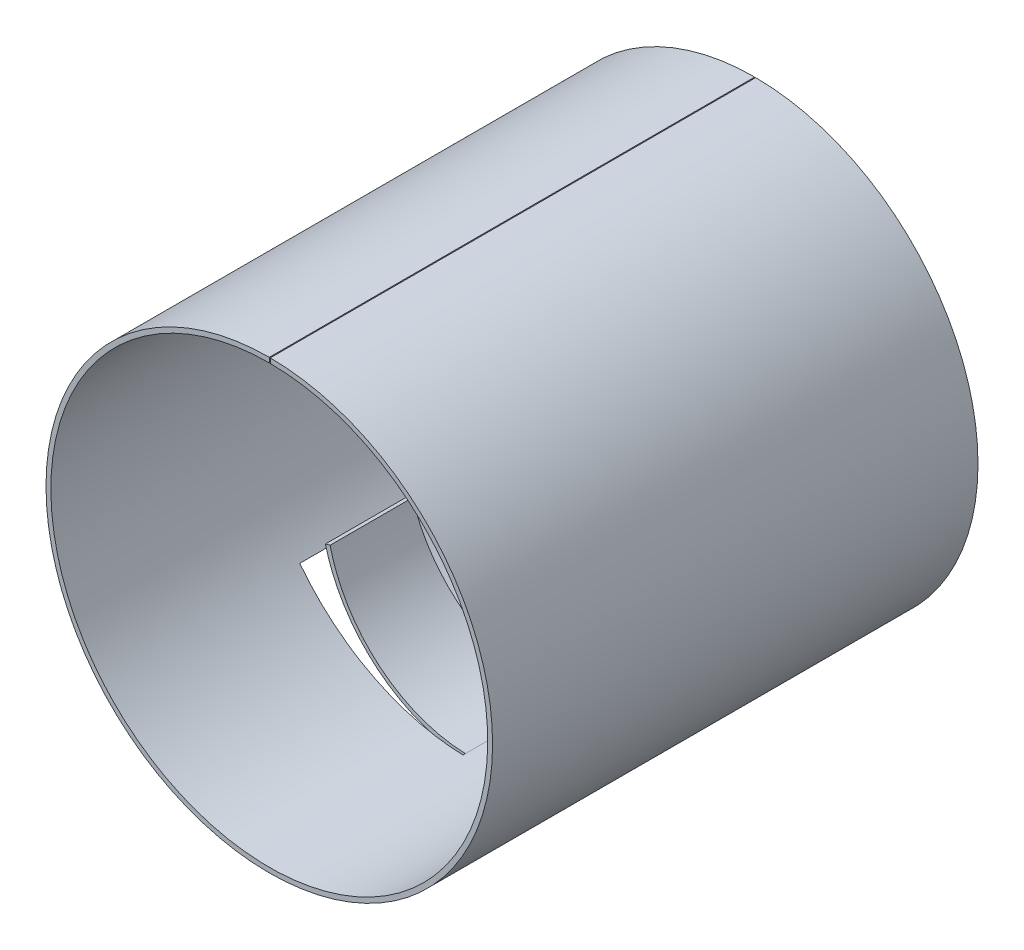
ISO-10303-21;
HEADER;
FILE_DESCRIPTION(('STEP AP214'),'2;1');
FILE_NAME('part.step','',(''),(''),'','','');
FILE_SCHEMA(('AUTOMOTIVE_DESIGN { 1 0 10303 214 1 1 1 1 }'));
ENDSEC;
DATA;
#1=APPLICATION_CONTEXT('core data for automotive mechanical design processes');
#2=APPLICATION_PROTOCOL_DEFINITION('international standard','automotive_design',2000,#1);
#3=PRODUCT_CONTEXT('',#1,'mechanical');
#4=PRODUCT('Part','Part','',(#3));
#5=PRODUCT_RELATED_PRODUCT_CATEGORY('part','',(#4));
#6=PRODUCT_DEFINITION_FORMATION('','',#4);
#7=PRODUCT_DEFINITION_CONTEXT('part definition',#1,'design');
#8=PRODUCT_DEFINITION('design','',#6,#7);
#9=PRODUCT_DEFINITION_SHAPE('','',#8);
#10=(LENGTH_UNIT() NAMED_UNIT(*) SI_UNIT(.MILLI.,.METRE.));
#11=(NAMED_UNIT(*) PLANE_ANGLE_UNIT() SI_UNIT($,.RADIAN.));
#12=(NAMED_UNIT(*) SI_UNIT($,.STERADIAN.) SOLID_ANGLE_UNIT());
#13=UNCERTAINTY_MEASURE_WITH_UNIT(LENGTH_MEASURE(1.E-05),#10,'distance_accuracy_value','');
#14=(GEOMETRIC_REPRESENTATION_CONTEXT(3) GLOBAL_UNCERTAINTY_ASSIGNED_CONTEXT((#13)) GLOBAL_UNIT_ASSIGNED_CONTEXT((#10,
#11,#12)) REPRESENTATION_CONTEXT('',''));
#15=CARTESIAN_POINT('',(0.,0.,0.));
#16=DIRECTION('',(0.,0.,1.));
#17=DIRECTION('',(1.,0.,0.));
#18=AXIS2_PLACEMENT_3D('',#15,#16,#17);
#19=CARTESIAN_POINT('',(-0.0997454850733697,-44.9998894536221,50.));
#20=DIRECTION('',(0.999997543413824,-0.00221656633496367,0.));
#21=DIRECTION('',(0.,0.,1.));
#22=AXIS2_PLACEMENT_3D('',#19,#20,#21);
#23=PLANE('',#22);
#24=DIRECTION('',(0.,0.,-1.));
#25=VECTOR('',#24,1.);
#26=CARTESIAN_POINT('',(-0.101962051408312,-45.9998869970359,352.681192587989));
#27=LINE('',#26,#25);
#28=CARTESIAN_POINT('',(-0.101962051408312,-45.9998869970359,40.));
#29=VERTEX_POINT('',#28);
#30=CARTESIAN_POINT('',(-0.101962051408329,-45.9998869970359,40.5));
#31=VERTEX_POINT('',#30);
#32=EDGE_CURVE('E467',#29,#31,#27,.F.);
#33=ORIENTED_EDGE('',*,*,#32,.T.);
#34=DIRECTION('',(-0.00221656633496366,-0.999997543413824,0.));
#35=VECTOR('',#34,1.);
#36=CARTESIAN_POINT('',(-0.101962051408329,-45.9998869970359,40.5));
#37=LINE('',#36,#35);
#38=CARTESIAN_POINT('',(-0.0997454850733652,-44.9998894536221,40.5));
#39=VERTEX_POINT('',#38);
#40=EDGE_CURVE('E254',#39,#31,#37,.T.);
#41=ORIENTED_EDGE('',*,*,#40,.F.);
#42=DIRECTION('',(0.,0.,1.));
#43=VECTOR('',#42,1.);
#44=CARTESIAN_POINT('',(-0.0997454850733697,-44.9998894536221,40.));
#45=LINE('',#44,#43);
#46=CARTESIAN_POINT('',(-0.0997454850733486,-44.9998894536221,40.));
#47=VERTEX_POINT('',#46);
#48=EDGE_CURVE('E245',#47,#39,#45,.T.);
#49=ORIENTED_EDGE('',*,*,#48,.F.);
#50=CARTESIAN_POINT('',(-0.101962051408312,-45.9998869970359,40.));
#51=CARTESIAN_POINT('',(-0.0997454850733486,-44.9998894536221,40.));
#52=B_SPLINE_CURVE_WITH_KNOTS('',1,(#50,#51),.UNSPECIFIED.,.F.,.F.,(2,2),(0.,1.),.UNSPECIFIED.);
#53=EDGE_CURVE('E146',#29,#47,#52,.T.);
#54=ORIENTED_EDGE('',*,*,#53,.F.);
#55=EDGE_LOOP('',(#33,#41,#49,#54));
#56=FACE_BOUND('',#55,.T.);
#57=ADVANCED_FACE('F136',(#56),#23,.F.);
#58=CARTESIAN_POINT('',(-0.0997454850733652,-44.9998894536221,59.5));
#59=VERTEX_POINT('',#58);
#60=CARTESIAN_POINT('',(-0.0997454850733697,-44.9998894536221,60.));
#61=VERTEX_POINT('',#60);
#62=EDGE_CURVE('E248',#59,#61,#45,.T.);
#63=ORIENTED_EDGE('',*,*,#62,.F.);
#64=DIRECTION('',(0.00221656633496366,0.999997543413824,0.));
#65=VECTOR('',#64,1.);
#66=CARTESIAN_POINT('',(-0.101962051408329,-45.9998869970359,59.5));
#67=LINE('',#66,#65);
#68=CARTESIAN_POINT('',(-0.101962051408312,-45.9998869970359,59.5));
#69=VERTEX_POINT('',#68);
#70=EDGE_CURVE('E279',#69,#59,#67,.T.);
#71=ORIENTED_EDGE('',*,*,#70,.F.);
#72=CARTESIAN_POINT('',(-0.101962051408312,-45.9998869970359,60.));
#73=VERTEX_POINT('',#72);
#74=EDGE_CURVE('E269',#69,#73,#27,.F.);
#75=ORIENTED_EDGE('',*,*,#74,.T.);
#76=CARTESIAN_POINT('',(-0.0997454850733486,-44.9998894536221,60.));
#77=CARTESIAN_POINT('',(-0.101962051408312,-45.9998869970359,60.));
#78=B_SPLINE_CURVE_WITH_KNOTS('',1,(#76,#77),.UNSPECIFIED.,.F.,.F.,(2,2),(0.,1.),.UNSPECIFIED.);
#79=EDGE_CURVE('E236',#73,#61,#78,.F.);
#80=ORIENTED_EDGE('',*,*,#79,.T.);
#81=EDGE_LOOP('',(#63,#71,#75,#80));
#82=FACE_BOUND('',#81,.T.);
#83=ADVANCED_FACE('F406',(#82),#23,.F.);
#84=CARTESIAN_POINT('',(-35.4931558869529,-29.2615085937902,41.));
#85=CARTESIAN_POINT('',(-33.3494174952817,-31.8617860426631,40.9166651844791));
#86=CARTESIAN_POINT('',(-30.9189542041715,-34.225354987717,40.8333333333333));
#87=CARTESIAN_POINT('',(-25.6009059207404,-38.3660040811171,40.6666666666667));
#88=CARTESIAN_POINT('',(-22.713565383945,-40.1428773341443,40.5833333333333));
#89=CARTESIAN_POINT('',(-16.6207165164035,-43.0245097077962,40.4166666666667));
#90=CARTESIAN_POINT('',(-13.4154445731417,-44.1291570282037,40.3333333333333));
#91=CARTESIAN_POINT('',(-6.8409173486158,-45.6131395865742,40.1666666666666));
#92=CARTESIAN_POINT('',(-3.47197708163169,-45.9924171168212,40.0833348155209));
#93=CARTESIAN_POINT('',(-0.101962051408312,-45.9998869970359,40.));
#94=CARTESIAN_POINT('',(-34.7215655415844,-28.6253888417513,41.));
#95=CARTESIAN_POINT('',(-32.624430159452,-31.1691385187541,40.9166651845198));
#96=CARTESIAN_POINT('',(-30.2468030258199,-33.4813255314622,40.8333333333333));
#97=CARTESIAN_POINT('',(-25.0443644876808,-37.5319605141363,40.6666666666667));
#98=CARTESIAN_POINT('',(-22.2197922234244,-39.2702060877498,40.5833333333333));
#99=CARTESIAN_POINT('',(-16.2593965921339,-42.0891942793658,40.4166666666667));
#100=CARTESIAN_POINT('',(-13.1238044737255,-43.1698275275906,40.3333333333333));
#101=CARTESIAN_POINT('',(-6.69220175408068,-44.6215495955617,40.1666666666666));
#102=CARTESIAN_POINT('',(-3.39649931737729,-44.9925819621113,40.0833348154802));
#103=CARTESIAN_POINT('',(-0.0997454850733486,-44.9998894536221,40.));
#104=B_SPLINE_SURFACE_WITH_KNOTS('',1,3,((#84,#85,#86,#87,#88,#89,#90,#91,#92,#93),(#94,#95,#96,
#97,#98,#99,#100,#101,#102,#103)),.UNSPECIFIED.,.F.,.F.,.F.,(2,2),(4,2,2,2,4),(0.,1.),(0.,0.25,
0.5,0.75,1.),.UNSPECIFIED.);
#105=CARTESIAN_POINT('',(-34.7215655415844,-28.6253888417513,41.));
#106=CARTESIAN_POINT('',(-35.4931558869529,-29.2615085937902,41.));
#107=B_SPLINE_CURVE_WITH_KNOTS('',1,(#105,#106),.UNSPECIFIED.,.F.,.F.,(2,2),(0.,1.),.UNSPECIFIED.);
#108=CARTESIAN_POINT('',(-35.4931558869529,-29.2615085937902,41.));
#109=VERTEX_POINT('',#108);
#110=CARTESIAN_POINT('',(-34.7215655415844,-28.6253888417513,41.));
#111=VERTEX_POINT('',#110);
#112=EDGE_CURVE('E13',#109,#111,#107,.F.);
#113=CARTESIAN_POINT('',(-35.4931558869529,-29.2615085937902,41.));
#114=CARTESIAN_POINT('',(-33.3494174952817,-31.8617860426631,40.9166651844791));
#115=CARTESIAN_POINT('',(-30.9189542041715,-34.225354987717,40.8333333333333));
#116=CARTESIAN_POINT('',(-25.6009059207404,-38.3660040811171,40.6666666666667));
#117=CARTESIAN_POINT('',(-22.713565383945,-40.1428773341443,40.5833333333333));
#118=CARTESIAN_POINT('',(-16.6207165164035,-43.0245097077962,40.4166666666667));
#119=CARTESIAN_POINT('',(-13.4154445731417,-44.1291570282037,40.3333333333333));
#120=CARTESIAN_POINT('',(-6.8409173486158,-45.6131395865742,40.1666666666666));
#121=CARTESIAN_POINT('',(-3.47197708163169,-45.9924171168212,40.0833348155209));
#122=CARTESIAN_POINT('',(-0.101962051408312,-45.9998869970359,40.));
#123=B_SPLINE_CURVE_WITH_KNOTS('',3,(#113,#114,#115,#116,#117,#118,#119,#120,#121,#122),
.UNSPECIFIED.,.F.,.F.,(4,2,2,2,4),(0.,0.25,0.5,0.75,1.),.UNSPECIFIED.);
#124=EDGE_CURVE('E229',#109,#29,#123,.T.);
#125=CARTESIAN_POINT('',(-0.0997454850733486,-44.9998894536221,40.));
#126=CARTESIAN_POINT('',(-3.39649931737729,-44.9925819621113,40.0833348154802));
#127=CARTESIAN_POINT('',(-6.69220175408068,-44.6215495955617,40.1666666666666));
#128=CARTESIAN_POINT('',(-13.1238044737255,-43.1698275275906,40.3333333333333));
#129=CARTESIAN_POINT('',(-16.2593965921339,-42.0891942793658,40.4166666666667));
#130=CARTESIAN_POINT('',(-22.2197922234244,-39.2702060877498,40.5833333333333));
#131=CARTESIAN_POINT('',(-25.0443644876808,-37.5319605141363,40.6666666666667));
#132=CARTESIAN_POINT('',(-30.2468030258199,-33.4813255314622,40.8333333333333));
#133=CARTESIAN_POINT('',(-32.624430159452,-31.1691385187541,40.9166651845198));
#134=CARTESIAN_POINT('',(-34.7215655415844,-28.6253888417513,41.));
#135=B_SPLINE_CURVE_WITH_KNOTS('',3,(#125,#126,#127,#128,#129,#130,#131,#132,#133,#134),
.UNSPECIFIED.,.F.,.F.,(4,2,2,2,4),(0.,0.25,0.5,0.75,1.),.UNSPECIFIED.);
#136=EDGE_CURVE('E225',#111,#47,#135,.F.);
#137=ORIENTED_EDGE('',*,*,#112,.F.);
#138=ORIENTED_EDGE('',*,*,#124,.T.);
#139=ORIENTED_EDGE('',*,*,#53,.T.);
#140=ORIENTED_EDGE('',*,*,#136,.F.);
#141=EDGE_LOOP('',(#137,#138,#139,#140));
#142=FACE_BOUND('',#141,.T.);
#143=ADVANCED_FACE('F224',(#142),#104,.F.);
#144=CARTESIAN_POINT('',(-0.101962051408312,-45.9998869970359,60.));
#145=CARTESIAN_POINT('',(-3.47197708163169,-45.9924171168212,59.9166651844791));
#146=CARTESIAN_POINT('',(-6.8409173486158,-45.6131395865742,59.8333333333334));
#147=CARTESIAN_POINT('',(-13.4154445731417,-44.1291570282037,59.6666666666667));
#148=CARTESIAN_POINT('',(-16.6207165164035,-43.0245097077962,59.5833333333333));
#149=CARTESIAN_POINT('',(-22.713565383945,-40.1428773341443,59.4166666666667));
#150=CARTESIAN_POINT('',(-25.6009059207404,-38.3660040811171,59.3333333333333));
#151=CARTESIAN_POINT('',(-30.9189542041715,-34.225354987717,59.1666666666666));
#152=CARTESIAN_POINT('',(-33.3494174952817,-31.8617860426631,59.0833348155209));
#153=CARTESIAN_POINT('',(-35.4931558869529,-29.2615085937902,59.));
#154=CARTESIAN_POINT('',(-0.0997454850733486,-44.9998894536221,60.));
#155=CARTESIAN_POINT('',(-3.39649931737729,-44.9925819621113,59.9166651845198));
#156=CARTESIAN_POINT('',(-6.69220175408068,-44.6215495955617,59.8333333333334));
#157=CARTESIAN_POINT('',(-13.1238044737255,-43.1698275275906,59.6666666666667));
#158=CARTESIAN_POINT('',(-16.2593965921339,-42.0891942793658,59.5833333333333));
#159=CARTESIAN_POINT('',(-22.2197922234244,-39.2702060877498,59.4166666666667));
#160=CARTESIAN_POINT('',(-25.0443644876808,-37.5319605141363,59.3333333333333));
#161=CARTESIAN_POINT('',(-30.2468030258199,-33.4813255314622,59.1666666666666));
#162=CARTESIAN_POINT('',(-32.624430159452,-31.1691385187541,59.0833348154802));
#163=CARTESIAN_POINT('',(-34.7215655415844,-28.6253888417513,59.));
#164=B_SPLINE_SURFACE_WITH_KNOTS('',1,3,((#144,#145,#146,#147,#148,#149,#150,#151,#152,#153),
(#154,#155,#156,#157,#158,#159,#160,#161,#162,#163)),.UNSPECIFIED.,.F.,.F.,.F.,(2,2),(4,2,2,2,
4),(0.,1.),(0.,0.25,0.5,0.75,1.),.UNSPECIFIED.);
#165=CARTESIAN_POINT('',(-0.101962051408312,-45.9998869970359,60.));
#166=CARTESIAN_POINT('',(-3.47197708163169,-45.9924171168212,59.9166651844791));
#167=CARTESIAN_POINT('',(-6.8409173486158,-45.6131395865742,59.8333333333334));
#168=CARTESIAN_POINT('',(-13.4154445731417,-44.1291570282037,59.6666666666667));
#169=CARTESIAN_POINT('',(-16.6207165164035,-43.0245097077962,59.5833333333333));
#170=CARTESIAN_POINT('',(-22.713565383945,-40.1428773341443,59.4166666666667));
#171=CARTESIAN_POINT('',(-25.6009059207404,-38.3660040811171,59.3333333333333));
#172=CARTESIAN_POINT('',(-30.9189542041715,-34.225354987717,59.1666666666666));
#173=CARTESIAN_POINT('',(-33.3494174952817,-31.8617860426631,59.0833348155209));
#174=CARTESIAN_POINT('',(-35.4931558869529,-29.2615085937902,59.));
#175=B_SPLINE_CURVE_WITH_KNOTS('',3,(#165,#166,#167,#168,#169,#170,#171,#172,#173,#174),
.UNSPECIFIED.,.F.,.F.,(4,2,2,2,4),(0.,0.25,0.5,0.75,1.),.UNSPECIFIED.);
#176=CARTESIAN_POINT('',(-35.4931558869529,-29.2615085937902,59.));
#177=VERTEX_POINT('',#176);
#178=EDGE_CURVE('E470',#73,#177,#175,.T.);
#179=CARTESIAN_POINT('',(-35.4931558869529,-29.2615085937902,59.));
#180=CARTESIAN_POINT('',(-34.7215655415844,-28.6253888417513,59.));
#181=B_SPLINE_CURVE_WITH_KNOTS('',1,(#179,#180),.UNSPECIFIED.,.F.,.F.,(2,2),(0.,1.),.UNSPECIFIED.);
#182=CARTESIAN_POINT('',(-34.7215655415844,-28.6253888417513,59.));
#183=VERTEX_POINT('',#182);
#184=EDGE_CURVE('E162',#177,#183,#181,.T.);
#185=CARTESIAN_POINT('',(-34.7215655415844,-28.6253888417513,59.));
#186=CARTESIAN_POINT('',(-32.624430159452,-31.1691385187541,59.0833348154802));
#187=CARTESIAN_POINT('',(-30.2468030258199,-33.4813255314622,59.1666666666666));
#188=CARTESIAN_POINT('',(-25.0443644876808,-37.5319605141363,59.3333333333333));
#189=CARTESIAN_POINT('',(-22.2197922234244,-39.2702060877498,59.4166666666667));
#190=CARTESIAN_POINT('',(-16.2593965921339,-42.0891942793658,59.5833333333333));
#191=CARTESIAN_POINT('',(-13.1238044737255,-43.1698275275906,59.6666666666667));
#192=CARTESIAN_POINT('',(-6.69220175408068,-44.6215495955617,59.8333333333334));
#193=CARTESIAN_POINT('',(-3.39649931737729,-44.9925819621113,59.9166651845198));
#194=CARTESIAN_POINT('',(-0.0997454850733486,-44.9998894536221,60.));
#195=B_SPLINE_CURVE_WITH_KNOTS('',3,(#185,#186,#187,#188,#189,#190,#191,#192,#193,#194),
.UNSPECIFIED.,.F.,.F.,(4,2,2,2,4),(0.,0.25,0.5,0.75,1.),.UNSPECIFIED.);
#196=EDGE_CURVE('E255',#61,#183,#195,.F.);
#197=ORIENTED_EDGE('',*,*,#79,.F.);
#198=ORIENTED_EDGE('',*,*,#178,.T.);
#199=ORIENTED_EDGE('',*,*,#184,.T.);
#200=ORIENTED_EDGE('',*,*,#196,.F.);
#201=EDGE_LOOP('',(#197,#198,#199,#200));
#202=FACE_BOUND('',#201,.T.);
#203=ADVANCED_FACE('F336',(#202),#164,.F.);
#204=CARTESIAN_POINT('',(0.,0.,100.));
#205=DIRECTION('',(0.,0.,-1.));
#206=DIRECTION('',(-1.,0.,0.));
#207=AXIS2_PLACEMENT_3D('',#204,#205,#206);
#208=PLANE('',#207);
#209=DIRECTION('',(0.,-1.,0.));
#210=VECTOR('',#209,1.);
#211=CARTESIAN_POINT('',(0.,45.,100.));
#212=LINE('',#211,#210);
#213=CARTESIAN_POINT('',(0.,46.,100.));
#214=VERTEX_POINT('',#213);
#215=CARTESIAN_POINT('',(0.,45.,100.));
#216=VERTEX_POINT('',#215);
#217=EDGE_CURVE('E203',#214,#216,#212,.T.);
#218=ORIENTED_EDGE('',*,*,#217,.F.);
#219=CARTESIAN_POINT('',(0.,0.,100.));
#220=DIRECTION('',(0.,0.,-1.));
#221=DIRECTION('',(-1.,0.,0.));
#222=AXIS2_PLACEMENT_3D('',#219,#220,#221);
#223=CIRCLE('',#222,46.);
#224=CARTESIAN_POINT('',(0.203923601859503,45.9995479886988,100.));
#225=VERTEX_POINT('',#224);
#226=EDGE_CURVE('E285',#214,#225,#223,.F.);
#227=ORIENTED_EDGE('',*,*,#226,.T.);
#228=DIRECTION('',(-0.0044331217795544,-0.999990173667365,0.));
#229=VECTOR('',#228,1.);
#230=CARTESIAN_POINT('',(0.199490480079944,44.9995578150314,100.));
#231=LINE('',#230,#229);
#232=CARTESIAN_POINT('',(0.199490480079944,44.9995578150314,100.));
#233=VERTEX_POINT('',#232);
#234=EDGE_CURVE('E391',#225,#233,#231,.T.);
#235=ORIENTED_EDGE('',*,*,#234,.T.);
#236=CARTESIAN_POINT('',(0.,0.,100.));
#237=DIRECTION('',(0.,0.,1.));
#238=DIRECTION('',(1.,0.,0.));
#239=AXIS2_PLACEMENT_3D('',#236,#237,#238);
#240=CIRCLE('',#239,45.);
#241=EDGE_CURVE('E469',#216,#233,#240,.T.);
#242=ORIENTED_EDGE('',*,*,#241,.F.);
#243=EDGE_LOOP('',(#218,#227,#235,#242));
#244=FACE_BOUND('',#243,.T.);
#245=ADVANCED_FACE('F348',(#244),#208,.F.);
#246=CARTESIAN_POINT('',(0.199490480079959,44.9995578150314,50.));
#247=DIRECTION('',(0.999990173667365,-0.00443312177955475,0.));
#248=DIRECTION('',(0.,0.,-1.));
#249=AXIS2_PLACEMENT_3D('',#246,#247,#248);
#250=PLANE('',#249);
#251=ORIENTED_EDGE('',*,*,#234,.F.);
#252=DIRECTION('',(0.,0.,-1.));
#253=VECTOR('',#252,1.);
#254=CARTESIAN_POINT('',(0.203923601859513,45.9995479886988,352.681192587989));
#255=LINE('',#254,#253);
#256=CARTESIAN_POINT('',(0.203923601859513,45.9995479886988,0.));
#257=VERTEX_POINT('',#256);
#258=EDGE_CURVE('E287',#225,#257,#255,.T.);
#259=ORIENTED_EDGE('',*,*,#258,.T.);
#260=DIRECTION('',(-0.00443312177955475,-0.999990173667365,0.));
#261=VECTOR('',#260,1.);
#262=CARTESIAN_POINT('',(0.199490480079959,44.9995578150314,0.));
#263=LINE('',#262,#261);
#264=CARTESIAN_POINT('',(0.199490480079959,44.9995578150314,0.));
#265=VERTEX_POINT('',#264);
#266=EDGE_CURVE('E389',#257,#265,#263,.T.);
#267=ORIENTED_EDGE('',*,*,#266,.T.);
#268=DIRECTION('',(0.,0.,-1.));
#269=VECTOR('',#268,1.);
#270=CARTESIAN_POINT('',(0.199490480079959,44.9995578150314,100.));
#271=LINE('',#270,#269);
#272=EDGE_CURVE('E473',#233,#265,#271,.T.);
#273=ORIENTED_EDGE('',*,*,#272,.F.);
#274=EDGE_LOOP('',(#251,#259,#267,#273));
#275=FACE_BOUND('',#274,.T.);
#276=ADVANCED_FACE('F645',(#275),#250,.F.);
#277=CARTESIAN_POINT('',(0.,0.,0.));
#278=DIRECTION('',(0.,0.,1.));
#279=DIRECTION('',(1.,0.,0.));
#280=AXIS2_PLACEMENT_3D('',#277,#278,#279);
#281=PLANE('',#280);
#282=ORIENTED_EDGE('',*,*,#266,.F.);
#283=CARTESIAN_POINT('',(0.,0.,0.));
#284=DIRECTION('',(0.,0.,-1.));
#285=DIRECTION('',(-1.,0.,0.));
#286=AXIS2_PLACEMENT_3D('',#283,#284,#285);
#287=CIRCLE('',#286,46.);
#288=CARTESIAN_POINT('',(0.,46.,0.));
#289=VERTEX_POINT('',#288);
#290=EDGE_CURVE('E292',#257,#289,#287,.T.);
#291=ORIENTED_EDGE('',*,*,#290,.T.);
#292=DIRECTION('',(0.,-1.,0.));
#293=VECTOR('',#292,1.);
#294=CARTESIAN_POINT('',(0.,45.,0.));
#295=LINE('',#294,#293);
#296=CARTESIAN_POINT('',(0.,45.,0.));
#297=VERTEX_POINT('',#296);
#298=EDGE_CURVE('E387',#289,#297,#295,.T.);
#299=ORIENTED_EDGE('',*,*,#298,.T.);
#300=CARTESIAN_POINT('',(0.,0.,0.));
#301=DIRECTION('',(0.,0.,-1.));
#302=DIRECTION('',(-1.,0.,0.));
#303=AXIS2_PLACEMENT_3D('',#300,#301,#302);
#304=CIRCLE('',#303,45.);
#305=EDGE_CURVE('E758',#265,#297,#304,.T.);
#306=ORIENTED_EDGE('',*,*,#305,.F.);
#307=EDGE_LOOP('',(#282,#291,#299,#306));
#308=FACE_BOUND('',#307,.T.);
#309=ADVANCED_FACE('F316',(#308),#281,.F.);
#310=CARTESIAN_POINT('',(0.,45.,50.));
#311=DIRECTION('',(-1.,0.,0.));
#312=DIRECTION('',(0.,0.,1.));
#313=AXIS2_PLACEMENT_3D('',#310,#311,#312);
#314=PLANE('',#313);
#315=DIRECTION('',(0.,0.,-1.));
#316=VECTOR('',#315,1.);
#317=CARTESIAN_POINT('',(0.,46.,352.681192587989));
#318=LINE('',#317,#316);
#319=EDGE_CURVE('E295',#289,#214,#318,.F.);
#320=ORIENTED_EDGE('',*,*,#319,.T.);
#321=ORIENTED_EDGE('',*,*,#217,.T.);
#322=DIRECTION('',(0.,0.,1.));
#323=VECTOR('',#322,1.);
#324=CARTESIAN_POINT('',(0.,45.,0.));
#325=LINE('',#324,#323);
#326=EDGE_CURVE('E249',#297,#216,#325,.T.);
#327=ORIENTED_EDGE('',*,*,#326,.F.);
#328=ORIENTED_EDGE('',*,*,#298,.F.);
#329=EDGE_LOOP('',(#320,#321,#327,#328));
#330=FACE_BOUND('',#329,.T.);
#331=ADVANCED_FACE('F349',(#330),#314,.F.);
#332=CARTESIAN_POINT('',(-34.7215655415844,-28.6253888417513,50.));
#333=DIRECTION('',(-0.636119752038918,0.771590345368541,0.));
#334=DIRECTION('',(0.,0.,-1.));
#335=AXIS2_PLACEMENT_3D('',#332,#333,#334);
#336=PLANE('',#335);
#337=DIRECTION('',(0.,0.,-1.));
#338=VECTOR('',#337,1.);
#339=CARTESIAN_POINT('',(-35.4931558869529,-29.2615085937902,352.681192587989));
#340=LINE('',#339,#338);
#341=EDGE_CURVE('E466',#177,#109,#340,.T.);
#342=ORIENTED_EDGE('',*,*,#341,.T.);
#343=ORIENTED_EDGE('',*,*,#112,.T.);
#344=DIRECTION('',(0.,0.,-1.));
#345=VECTOR('',#344,1.);
#346=CARTESIAN_POINT('',(-34.7215655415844,-28.6253888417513,59.));
#347=LINE('',#346,#345);
#348=EDGE_CURVE('E246',#183,#111,#347,.T.);
#349=ORIENTED_EDGE('',*,*,#348,.F.);
#350=ORIENTED_EDGE('',*,*,#184,.F.);
#351=EDGE_LOOP('',(#342,#343,#349,#350));
#352=FACE_BOUND('',#351,.T.);
#353=ADVANCED_FACE('F138',(#352),#336,.F.);
#354=CARTESIAN_POINT('',(0.,0.,352.681192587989));
#355=DIRECTION('',(0.,0.,-1.));
#356=DIRECTION('',(-1.,0.,0.));
#357=AXIS2_PLACEMENT_3D('',#354,#355,#356);
#358=CYLINDRICAL_SURFACE('',#357,45.);
#359=ORIENTED_EDGE('',*,*,#305,.T.);
#360=ORIENTED_EDGE('',*,*,#326,.T.);
#361=ORIENTED_EDGE('',*,*,#241,.T.);
#362=ORIENTED_EDGE('',*,*,#272,.T.);
#363=EDGE_LOOP('',(#359,#360,#361,#362));
#364=FACE_BOUND('',#363,.T.);
#365=ORIENTED_EDGE('',*,*,#196,.T.);
#366=ORIENTED_EDGE('',*,*,#348,.T.);
#367=ORIENTED_EDGE('',*,*,#136,.T.);
#368=ORIENTED_EDGE('',*,*,#48,.T.);
#369=DIRECTION('',(0.,0.,-1.));
#370=VECTOR('',#369,1.);
#371=CARTESIAN_POINT('',(-0.0997454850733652,-44.9998894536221,40.5));
#372=LINE('',#371,#370);
#373=EDGE_CURVE('E273',#59,#39,#372,.T.);
#374=ORIENTED_EDGE('',*,*,#373,.F.);
#375=ORIENTED_EDGE('',*,*,#62,.T.);
#376=EDGE_LOOP('',(#365,#366,#367,#368,#374,#375));
#377=FACE_BOUND('',#376,.T.);
#378=ADVANCED_FACE('F242',(#364,#377),#358,.F.);
#379=CARTESIAN_POINT('',(0.,0.,352.681192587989));
#380=DIRECTION('',(0.,0.,-1.));
#381=DIRECTION('',(-1.,0.,0.));
#382=AXIS2_PLACEMENT_3D('',#379,#380,#381);
#383=CYLINDRICAL_SURFACE('',#382,46.);
#384=ORIENTED_EDGE('',*,*,#290,.F.);
#385=ORIENTED_EDGE('',*,*,#258,.F.);
#386=ORIENTED_EDGE('',*,*,#226,.F.);
#387=ORIENTED_EDGE('',*,*,#319,.F.);
#388=EDGE_LOOP('',(#384,#385,#386,#387));
#389=FACE_BOUND('',#388,.T.);
#390=ORIENTED_EDGE('',*,*,#178,.F.);
#391=ORIENTED_EDGE('',*,*,#74,.F.);
#392=DIRECTION('',(0.,0.,1.));
#393=VECTOR('',#392,1.);
#394=CARTESIAN_POINT('',(-0.101962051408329,-45.9998869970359,40.5));
#395=LINE('',#394,#393);
#396=EDGE_CURVE('E153',#31,#69,#395,.T.);
#397=ORIENTED_EDGE('',*,*,#396,.F.);
#398=ORIENTED_EDGE('',*,*,#32,.F.);
#399=ORIENTED_EDGE('',*,*,#124,.F.);
#400=ORIENTED_EDGE('',*,*,#341,.F.);
#401=EDGE_LOOP('',(#390,#391,#397,#398,#399,#400));
#402=FACE_BOUND('',#401,.T.);
#403=ADVANCED_FACE('F314',(#389,#402),#383,.T.);
#404=CARTESIAN_POINT('',(-29.9421193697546,-23.023450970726,41.5));
#405=DIRECTION('',(0.258819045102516,-0.96592582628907,0.));
#406=DIRECTION('',(0.96592582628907,0.258819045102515,0.));
#407=AXIS2_PLACEMENT_3D('',#404,#405,#406);
#408=PLANE('',#407);
#409=DIRECTION('',(0.,0.,-1.));
#410=VECTOR('',#409,1.);
#411=CARTESIAN_POINT('',(-29.9421193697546,-23.023450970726,58.5));
#412=LINE('',#411,#410);
#413=CARTESIAN_POINT('',(-29.9421193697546,-23.023450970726,58.5));
#414=VERTEX_POINT('',#413);
#415=CARTESIAN_POINT('',(-29.9421193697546,-23.023450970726,41.5));
#416=VERTEX_POINT('',#415);
#417=EDGE_CURVE('E505',#414,#416,#412,.T.);
#418=ORIENTED_EDGE('',*,*,#417,.F.);
#419=DIRECTION('',(-0.965925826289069,-0.25881904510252,0.));
#420=VECTOR('',#419,1.);
#421=CARTESIAN_POINT('',(-29.9421193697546,-23.023450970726,58.5));
#422=LINE('',#421,#420);
#423=CARTESIAN_POINT('',(-28.9761935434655,-22.7646319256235,58.5));
#424=VERTEX_POINT('',#423);
#425=EDGE_CURVE('E524',#424,#414,#422,.T.);
#426=ORIENTED_EDGE('',*,*,#425,.F.);
#427=DIRECTION('',(0.,0.,1.));
#428=VECTOR('',#427,1.);
#429=CARTESIAN_POINT('',(-28.9761935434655,-22.7646319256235,58.5));
#430=LINE('',#429,#428);
#431=CARTESIAN_POINT('',(-28.9761935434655,-22.7646319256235,41.5));
#432=VERTEX_POINT('',#431);
#433=EDGE_CURVE('E498',#432,#424,#430,.T.);
#434=ORIENTED_EDGE('',*,*,#433,.F.);
#435=DIRECTION('',(0.96592582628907,0.258819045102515,0.));
#436=VECTOR('',#435,1.);
#437=CARTESIAN_POINT('',(-29.9421193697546,-23.023450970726,41.5));
#438=LINE('',#437,#436);
#439=EDGE_CURVE('E502',#416,#432,#438,.T.);
#440=ORIENTED_EDGE('',*,*,#439,.F.);
#441=EDGE_LOOP('',(#418,#426,#434,#440));
#442=FACE_BOUND('',#441,.T.);
#443=ADVANCED_FACE('F317',(#442),#408,.F.);
#444=CARTESIAN_POINT('',(-0.0997454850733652,-44.9998894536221,59.5));
#445=CARTESIAN_POINT('',(-13.6312125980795,-44.9546135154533,59.1666666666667));
#446=CARTESIAN_POINT('',(-25.4718188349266,-35.8431363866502,58.8333333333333));
#447=CARTESIAN_POINT('',(-28.9761935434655,-22.7646319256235,58.5));
#448=CARTESIAN_POINT('',(-0.0997454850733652,-44.9998894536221,58.7127308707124));
#449=CARTESIAN_POINT('',(-13.6312125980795,-44.9546135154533,58.4043902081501));
#450=CARTESIAN_POINT('',(-25.4718188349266,-35.8431363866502,58.0960495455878));
#451=CARTESIAN_POINT('',(-28.9761935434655,-22.7646319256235,57.7877088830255));
#452=CARTESIAN_POINT('',(-0.0997454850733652,-44.9998894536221,57.1338375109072));
#453=CARTESIAN_POINT('',(-13.6312125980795,-44.9546135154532,56.8782659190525));
#454=CARTESIAN_POINT('',(-25.4718188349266,-35.8431363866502,56.6226943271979));
#455=CARTESIAN_POINT('',(-28.9761935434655,-22.7646319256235,56.3671227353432));
#456=CARTESIAN_POINT('',(-0.0997454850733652,-44.9998894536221,54.7572008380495));
#457=CARTESIAN_POINT('',(-13.6312125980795,-44.9546135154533,54.5860063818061));
#458=CARTESIAN_POINT('',(-25.4718188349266,-35.8431363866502,54.4148119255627));
#459=CARTESIAN_POINT('',(-28.9761935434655,-22.7646319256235,54.2436174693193));
#460=CARTESIAN_POINT('',(-0.0997454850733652,-44.9998894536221,52.3772141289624));
#461=CARTESIAN_POINT('',(-13.6312125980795,-44.9546135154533,52.2924876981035));
#462=CARTESIAN_POINT('',(-25.4718188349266,-35.8431363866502,52.2077612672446));
#463=CARTESIAN_POINT('',(-28.9761935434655,-22.7646319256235,52.1230348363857));
#464=CARTESIAN_POINT('',(-0.0997454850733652,-44.9998894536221,50.7916666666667));
#465=CARTESIAN_POINT('',(-13.6312125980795,-44.9546135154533,50.7638888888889));
#466=CARTESIAN_POINT('',(-25.4718188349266,-35.8431363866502,50.7361111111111));
#467=CARTESIAN_POINT('',(-28.9761935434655,-22.7646319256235,50.7083333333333));
#468=CARTESIAN_POINT('',(-0.0997454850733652,-44.9998894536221,49.2083333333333));
#469=CARTESIAN_POINT('',(-13.6312125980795,-44.9546135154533,49.2361111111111));
#470=CARTESIAN_POINT('',(-25.4718188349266,-35.8431363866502,49.2638888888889));
#471=CARTESIAN_POINT('',(-28.9761935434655,-22.7646319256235,49.2916666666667));
#472=CARTESIAN_POINT('',(-0.0997454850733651,-44.9998894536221,47.6227858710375));
#473=CARTESIAN_POINT('',(-13.6312125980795,-44.9546135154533,47.7075123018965));
#474=CARTESIAN_POINT('',(-25.4718188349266,-35.8431363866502,47.7922387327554));
#475=CARTESIAN_POINT('',(-28.9761935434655,-22.7646319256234,47.8769651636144));
#476=CARTESIAN_POINT('',(-0.0997454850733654,-44.9998894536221,45.2427991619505));
#477=CARTESIAN_POINT('',(-13.6312125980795,-44.9546135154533,45.4139936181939));
#478=CARTESIAN_POINT('',(-25.4718188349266,-35.8431363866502,45.5851880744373));
#479=CARTESIAN_POINT('',(-28.9761935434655,-22.7646319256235,45.7563825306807));
#480=CARTESIAN_POINT('',(-0.0997454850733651,-44.9998894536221,42.8661624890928));
#481=CARTESIAN_POINT('',(-13.6312125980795,-44.9546135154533,43.1217340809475));
#482=CARTESIAN_POINT('',(-25.4718188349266,-35.8431363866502,43.3773056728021));
#483=CARTESIAN_POINT('',(-28.9761935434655,-22.7646319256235,43.6328772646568));
#484=CARTESIAN_POINT('',(-0.0997454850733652,-44.9998894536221,41.2872691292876));
#485=CARTESIAN_POINT('',(-13.6312125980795,-44.9546135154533,41.5956097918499));
#486=CARTESIAN_POINT('',(-25.4718188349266,-35.8431363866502,41.9039504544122));
#487=CARTESIAN_POINT('',(-28.9761935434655,-22.7646319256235,42.2122911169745));
#488=CARTESIAN_POINT('',(-0.0997454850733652,-44.9998894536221,40.5));
#489=CARTESIAN_POINT('',(-13.6312125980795,-44.9546135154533,40.8333333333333));
#490=CARTESIAN_POINT('',(-25.4718188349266,-35.8431363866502,41.1666666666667));
#491=CARTESIAN_POINT('',(-28.9761935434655,-22.7646319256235,41.5));
#492=B_SPLINE_SURFACE_WITH_KNOTS('',3,3,((#444,#445,#446,#447),(#448,#449,#450,#451),(#452,#453,
#454,#455),(#456,#457,#458,#459),(#460,#461,#462,#463),(#464,#465,#466,#467),(#468,#469,#470,
#471),(#472,#473,#474,#475),(#476,#477,#478,#479),(#480,#481,#482,#483),(#484,#485,#486,#487),
(#488,#489,#490,#491)),.UNSPECIFIED.,.F.,.F.,.F.,(4,1,1,1,2,1,1,1,4),(4,4),(0.526388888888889,
0.585590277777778,0.644791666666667,0.703993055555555,0.763194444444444,0.822395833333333,
0.881597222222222,0.940798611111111,1.),(0.,1.),.UNSPECIFIED.);
#493=CARTESIAN_POINT('',(-0.0997454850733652,-44.9998894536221,40.5));
#494=CARTESIAN_POINT('',(-13.6312125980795,-44.9546135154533,40.8333333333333));
#495=CARTESIAN_POINT('',(-25.4718188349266,-35.8431363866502,41.1666666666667));
#496=CARTESIAN_POINT('',(-28.9761935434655,-22.7646319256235,41.5));
#497=B_SPLINE_CURVE_WITH_KNOTS('',3,(#493,#494,#495,#496),.UNSPECIFIED.,.F.,.F.,(4,4),(0.,1.),.UNSPECIFIED.);
#498=EDGE_CURVE('E274',#39,#432,#497,.T.);
#499=CARTESIAN_POINT('',(-0.0997454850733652,-44.9998894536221,59.5));
#500=CARTESIAN_POINT('',(-13.6312125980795,-44.9546135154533,59.1666666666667));
#501=CARTESIAN_POINT('',(-25.4718188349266,-35.8431363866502,58.8333333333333));
#502=CARTESIAN_POINT('',(-28.9761935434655,-22.7646319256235,58.5));
#503=B_SPLINE_CURVE_WITH_KNOTS('',3,(#499,#500,#501,#502),.UNSPECIFIED.,.F.,.F.,(4,4),(0.,1.),.UNSPECIFIED.);
#504=EDGE_CURVE('E526',#59,#424,#503,.T.);
#505=ORIENTED_EDGE('',*,*,#373,.T.);
#506=ORIENTED_EDGE('',*,*,#498,.T.);
#507=ORIENTED_EDGE('',*,*,#433,.T.);
#508=ORIENTED_EDGE('',*,*,#504,.F.);
#509=EDGE_LOOP('',(#505,#506,#507,#508));
#510=FACE_BOUND('',#509,.T.);
#511=ADVANCED_FACE('F577',(#510),#492,.T.);
#512=CARTESIAN_POINT('',(-0.101962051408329,-45.9998869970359,59.5));
#513=CARTESIAN_POINT('',(-13.9546655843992,-45.70755155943,59.1666666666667));
#514=CARTESIAN_POINT('',(-26.116508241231,-36.3490149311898,58.8333333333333));
#515=CARTESIAN_POINT('',(-29.9421193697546,-23.023450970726,58.5));
#516=CARTESIAN_POINT('',(-0.101777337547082,-45.9165538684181,59.5));
#517=CARTESIAN_POINT('',(-13.9277111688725,-45.6448067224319,59.1666666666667));
#518=CARTESIAN_POINT('',(-26.0627841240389,-36.3068583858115,58.8333333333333));
#519=CARTESIAN_POINT('',(-29.8616255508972,-23.0018827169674,58.5));
#520=CARTESIAN_POINT('',(-0.101407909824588,-45.7498876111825,59.5000000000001));
#521=CARTESIAN_POINT('',(-13.8738023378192,-45.5193170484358,59.1666666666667));
#522=CARTESIAN_POINT('',(-25.9553358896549,-36.2225452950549,58.8333333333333));
#523=CARTESIAN_POINT('',(-29.7006379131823,-22.9587462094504,58.5));
#524=CARTESIAN_POINT('',(-0.100853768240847,-45.499888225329,59.4999999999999));
#525=CARTESIAN_POINT('',(-13.7929390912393,-45.3310825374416,59.1666666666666));
#526=CARTESIAN_POINT('',(-25.7941635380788,-36.09607565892,58.8333333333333));
#527=CARTESIAN_POINT('',(-29.4591564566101,-22.8940414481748,58.5));
#528=CARTESIAN_POINT('',(-0.100299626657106,-45.2498888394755,59.5000000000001));
#529=CARTESIAN_POINT('',(-13.7120758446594,-45.1428480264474,59.1666666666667));
#530=CARTESIAN_POINT('',(-25.6329911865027,-35.9696060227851,58.8333333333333));
#531=CARTESIAN_POINT('',(-29.2176750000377,-22.8293366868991,58.5));
#532=CARTESIAN_POINT('',(-0.0999301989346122,-45.0832225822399,59.5));
#533=CARTESIAN_POINT('',(-13.6581670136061,-45.0173583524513,59.1666666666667));
#534=CARTESIAN_POINT('',(-25.5255429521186,-35.8852929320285,58.8333333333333));
#535=CARTESIAN_POINT('',(-29.0566873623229,-22.786200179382,58.5));
#536=CARTESIAN_POINT('',(-0.0997454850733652,-44.9998894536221,59.5));
#537=CARTESIAN_POINT('',(-13.6312125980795,-44.9546135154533,59.1666666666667));
#538=CARTESIAN_POINT('',(-25.4718188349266,-35.8431363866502,58.8333333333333));
#539=CARTESIAN_POINT('',(-28.9761935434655,-22.7646319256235,58.5));
#540=B_SPLINE_SURFACE_WITH_KNOTS('',3,3,((#512,#513,#514,#515),(#516,#517,#518,#519),(#520,#521,
#522,#523),(#524,#525,#526,#527),(#528,#529,#530,#531),(#532,#533,#534,#535),(#536,#537,#538,
#539)),.UNSPECIFIED.,.F.,.F.,.F.,(4,1,1,1,4),(4,4),(0.5,0.506597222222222,0.513194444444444,
0.519791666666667,0.526388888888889),(0.,1.),.UNSPECIFIED.);
#541=CARTESIAN_POINT('',(-0.101962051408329,-45.9998869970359,59.5));
#542=CARTESIAN_POINT('',(-13.9546655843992,-45.70755155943,59.1666666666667));
#543=CARTESIAN_POINT('',(-26.116508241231,-36.3490149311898,58.8333333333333));
#544=CARTESIAN_POINT('',(-29.9421193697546,-23.023450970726,58.5));
#545=B_SPLINE_CURVE_WITH_KNOTS('',3,(#541,#542,#543,#544),.UNSPECIFIED.,.F.,.F.,(4,4),(0.,1.),.UNSPECIFIED.);
#546=EDGE_CURVE('E518',#69,#414,#545,.T.);
#547=ORIENTED_EDGE('',*,*,#70,.T.);
#548=ORIENTED_EDGE('',*,*,#504,.T.);
#549=ORIENTED_EDGE('',*,*,#425,.T.);
#550=ORIENTED_EDGE('',*,*,#546,.F.);
#551=EDGE_LOOP('',(#547,#548,#549,#550));
#552=FACE_BOUND('',#551,.T.);
#553=ADVANCED_FACE('F566',(#552),#540,.T.);
#554=CARTESIAN_POINT('',(-0.101962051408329,-45.9998869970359,40.5));
#555=CARTESIAN_POINT('',(-13.9546655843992,-45.70755155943,40.8333333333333));
#556=CARTESIAN_POINT('',(-26.116508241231,-36.3490149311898,41.1666666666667));
#557=CARTESIAN_POINT('',(-29.9421193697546,-23.023450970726,41.5));
#558=CARTESIAN_POINT('',(-0.101962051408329,-45.9998869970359,42.0833333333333));
#559=CARTESIAN_POINT('',(-13.9546655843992,-45.70755155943,42.3611111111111));
#560=CARTESIAN_POINT('',(-26.116508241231,-36.3490149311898,42.6388888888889));
#561=CARTESIAN_POINT('',(-29.9421193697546,-23.023450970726,42.9166666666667));
#562=CARTESIAN_POINT('',(-0.101962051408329,-45.9998869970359,45.25));
#563=CARTESIAN_POINT('',(-13.9546655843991,-45.70755155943,45.4166666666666));
#564=CARTESIAN_POINT('',(-26.1165082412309,-36.3490149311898,45.5833333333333));
#565=CARTESIAN_POINT('',(-29.9421193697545,-23.023450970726,45.75));
#566=CARTESIAN_POINT('',(-0.101962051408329,-45.9998869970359,50.));
#567=CARTESIAN_POINT('',(-13.9546655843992,-45.70755155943,50.));
#568=CARTESIAN_POINT('',(-26.116508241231,-36.3490149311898,50.));
#569=CARTESIAN_POINT('',(-29.9421193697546,-23.023450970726,50.));
#570=CARTESIAN_POINT('',(-0.101962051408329,-45.9998869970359,54.75));
#571=CARTESIAN_POINT('',(-13.9546655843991,-45.70755155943,54.5833333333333));
#572=CARTESIAN_POINT('',(-26.1165082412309,-36.3490149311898,54.4166666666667));
#573=CARTESIAN_POINT('',(-29.9421193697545,-23.023450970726,54.25));
#574=CARTESIAN_POINT('',(-0.101962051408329,-45.9998869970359,57.9166666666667));
#575=CARTESIAN_POINT('',(-13.9546655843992,-45.70755155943,57.6388888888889));
#576=CARTESIAN_POINT('',(-26.116508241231,-36.3490149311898,57.3611111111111));
#577=CARTESIAN_POINT('',(-29.9421193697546,-23.023450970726,57.0833333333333));
#578=CARTESIAN_POINT('',(-0.101962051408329,-45.9998869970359,59.5));
#579=CARTESIAN_POINT('',(-13.9546655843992,-45.70755155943,59.1666666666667));
#580=CARTESIAN_POINT('',(-26.116508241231,-36.3490149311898,58.8333333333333));
#581=CARTESIAN_POINT('',(-29.9421193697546,-23.023450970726,58.5));
#582=B_SPLINE_SURFACE_WITH_KNOTS('',3,3,((#554,#555,#556,#557),(#558,#559,#560,#561),(#562,#563,
#564,#565),(#566,#567,#568,#569),(#570,#571,#572,#573),(#574,#575,#576,#577),(#578,#579,#580,
#581)),.UNSPECIFIED.,.F.,.F.,.F.,(4,1,1,1,4),(4,4),(0.0263888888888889,0.144791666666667,
0.263194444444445,0.381597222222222,0.5),(0.,1.),.UNSPECIFIED.);
#583=CARTESIAN_POINT('',(-0.101962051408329,-45.9998869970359,40.5));
#584=CARTESIAN_POINT('',(-13.9546655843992,-45.70755155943,40.8333333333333));
#585=CARTESIAN_POINT('',(-26.116508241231,-36.3490149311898,41.1666666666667));
#586=CARTESIAN_POINT('',(-29.9421193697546,-23.023450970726,41.5));
#587=B_SPLINE_CURVE_WITH_KNOTS('',3,(#583,#584,#585,#586),.UNSPECIFIED.,.F.,.F.,(4,4),(0.,1.),.UNSPECIFIED.);
#588=EDGE_CURVE('E517',#31,#416,#587,.T.);
#589=ORIENTED_EDGE('',*,*,#396,.T.);
#590=ORIENTED_EDGE('',*,*,#546,.T.);
#591=ORIENTED_EDGE('',*,*,#417,.T.);
#592=ORIENTED_EDGE('',*,*,#588,.F.);
#593=EDGE_LOOP('',(#589,#590,#591,#592));
#594=FACE_BOUND('',#593,.T.);
#595=ADVANCED_FACE('F516',(#594),#582,.T.);
#596=CARTESIAN_POINT('',(-0.0997454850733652,-44.9998894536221,40.5));
#597=CARTESIAN_POINT('',(-13.6312125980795,-44.9546135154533,40.8333333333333));
#598=CARTESIAN_POINT('',(-25.4718188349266,-35.8431363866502,41.1666666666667));
#599=CARTESIAN_POINT('',(-28.9761935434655,-22.7646319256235,41.5));
#600=CARTESIAN_POINT('',(-0.0999301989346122,-45.0832225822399,40.5));
#601=CARTESIAN_POINT('',(-13.6581670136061,-45.0173583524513,40.8333333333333));
#602=CARTESIAN_POINT('',(-25.5255429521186,-35.8852929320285,41.1666666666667));
#603=CARTESIAN_POINT('',(-29.0566873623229,-22.786200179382,41.5));
#604=CARTESIAN_POINT('',(-0.100299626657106,-45.2498888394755,40.5));
#605=CARTESIAN_POINT('',(-13.7120758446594,-45.1428480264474,40.8333333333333));
#606=CARTESIAN_POINT('',(-25.6329911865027,-35.9696060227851,41.1666666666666));
#607=CARTESIAN_POINT('',(-29.2176750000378,-22.8293366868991,41.5));
#608=CARTESIAN_POINT('',(-0.100853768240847,-45.499888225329,40.5));
#609=CARTESIAN_POINT('',(-13.7929390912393,-45.3310825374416,40.8333333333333));
#610=CARTESIAN_POINT('',(-25.7941635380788,-36.09607565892,41.1666666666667));
#611=CARTESIAN_POINT('',(-29.45915645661,-22.8940414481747,41.5000000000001));
#612=CARTESIAN_POINT('',(-0.101407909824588,-45.7498876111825,40.5));
#613=CARTESIAN_POINT('',(-13.8738023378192,-45.5193170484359,40.8333333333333));
#614=CARTESIAN_POINT('',(-25.9553358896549,-36.222545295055,41.1666666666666));
#615=CARTESIAN_POINT('',(-29.7006379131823,-22.9587462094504,41.4999999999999));
#616=CARTESIAN_POINT('',(-0.101777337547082,-45.9165538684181,40.5));
#617=CARTESIAN_POINT('',(-13.9277111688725,-45.6448067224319,40.8333333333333));
#618=CARTESIAN_POINT('',(-26.0627841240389,-36.3068583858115,41.1666666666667));
#619=CARTESIAN_POINT('',(-29.8616255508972,-23.0018827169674,41.5));
#620=CARTESIAN_POINT('',(-0.101962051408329,-45.9998869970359,40.5));
#621=CARTESIAN_POINT('',(-13.9546655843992,-45.70755155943,40.8333333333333));
#622=CARTESIAN_POINT('',(-26.116508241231,-36.3490149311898,41.1666666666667));
#623=CARTESIAN_POINT('',(-29.9421193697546,-23.023450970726,41.5));
#624=B_SPLINE_SURFACE_WITH_KNOTS('',3,3,((#596,#597,#598,#599),(#600,#601,#602,#603),(#604,#605,
#606,#607),(#608,#609,#610,#611),(#612,#613,#614,#615),(#616,#617,#618,#619),(#620,#621,#622,
#623)),.UNSPECIFIED.,.F.,.F.,.F.,(4,1,1,1,4),(4,4),(0.,0.00659722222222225,0.0131944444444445,
0.0197916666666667,0.0263888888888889),(0.,1.),.UNSPECIFIED.);
#625=ORIENTED_EDGE('',*,*,#40,.T.);
#626=ORIENTED_EDGE('',*,*,#588,.T.);
#627=ORIENTED_EDGE('',*,*,#439,.T.);
#628=ORIENTED_EDGE('',*,*,#498,.F.);
#629=EDGE_LOOP('',(#625,#626,#627,#628));
#630=FACE_BOUND('',#629,.T.);
#631=ADVANCED_FACE('F523',(#630),#624,.T.);
#632=CLOSED_SHELL('',(#57,#83,#143,#203,#245,#276,#309,#331,#353,#378,#403,#443,#511,#553,#595,#631));
#633=MANIFOLD_SOLID_BREP('B2',#632);
#634=ADVANCED_BREP_SHAPE_REPRESENTATION('',(#18,#633),#14);
#635=SHAPE_DEFINITION_REPRESENTATION(#9,#634);
ENDSEC;
END-ISO-10303-21;
